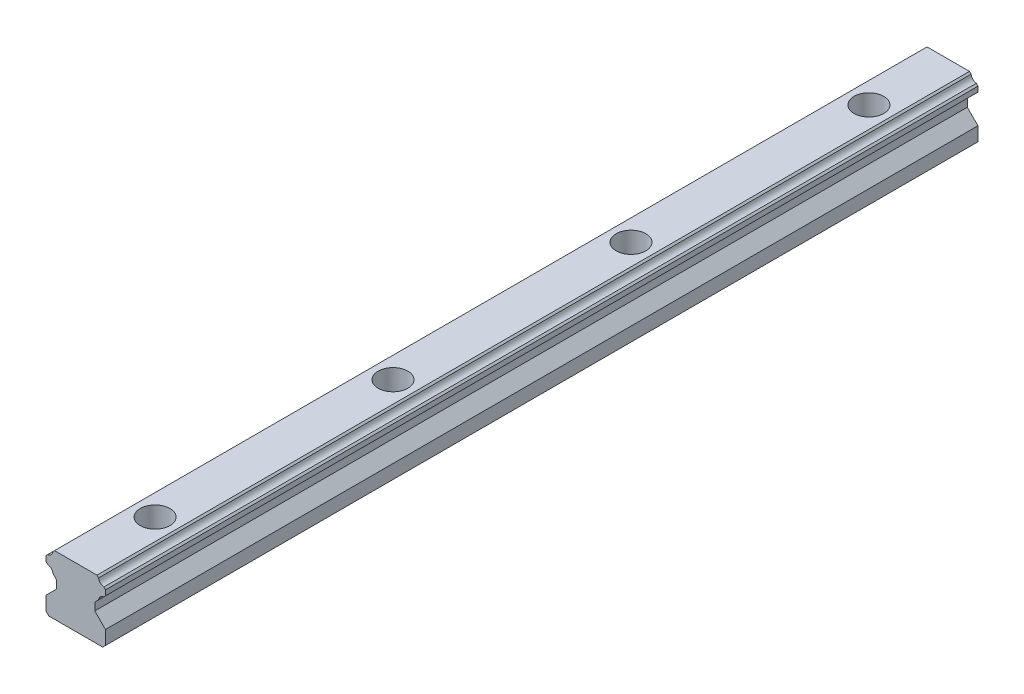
ISO-10303-21;
HEADER;
FILE_DESCRIPTION(('STEP AP214'),'2;1');
FILE_NAME('part.step','',(''),(''),'','','');
FILE_SCHEMA(('AUTOMOTIVE_DESIGN { 1 0 10303 214 1 1 1 1 }'));
ENDSEC;
DATA;
#1=APPLICATION_CONTEXT('core data for automotive mechanical design processes');
#2=APPLICATION_PROTOCOL_DEFINITION('international standard','automotive_design',2000,#1);
#3=PRODUCT_CONTEXT('',#1,'mechanical');
#4=PRODUCT('Part','Part','',(#3));
#5=PRODUCT_RELATED_PRODUCT_CATEGORY('part','',(#4));
#6=PRODUCT_DEFINITION_FORMATION('','',#4);
#7=PRODUCT_DEFINITION_CONTEXT('part definition',#1,'design');
#8=PRODUCT_DEFINITION('design','',#6,#7);
#9=PRODUCT_DEFINITION_SHAPE('','',#8);
#10=(LENGTH_UNIT() NAMED_UNIT(*) SI_UNIT(.MILLI.,.METRE.));
#11=(NAMED_UNIT(*) PLANE_ANGLE_UNIT() SI_UNIT($,.RADIAN.));
#12=(NAMED_UNIT(*) SI_UNIT($,.STERADIAN.) SOLID_ANGLE_UNIT());
#13=UNCERTAINTY_MEASURE_WITH_UNIT(LENGTH_MEASURE(1.E-05),#10,'distance_accuracy_value','');
#14=(GEOMETRIC_REPRESENTATION_CONTEXT(3) GLOBAL_UNCERTAINTY_ASSIGNED_CONTEXT((#13)) GLOBAL_UNIT_ASSIGNED_CONTEXT((#10,
#11,#12)) REPRESENTATION_CONTEXT('',''));
#15=CARTESIAN_POINT('',(0.,0.,0.));
#16=DIRECTION('',(0.,0.,1.));
#17=DIRECTION('',(1.,0.,0.));
#18=AXIS2_PLACEMENT_3D('',#15,#16,#17);
#19=CARTESIAN_POINT('',(0.,15.0000000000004,-90.));
#20=DIRECTION('',(0.,1.,0.));
#21=DIRECTION('',(0.,0.,1.));
#22=AXIS2_PLACEMENT_3D('',#19,#20,#21);
#23=CYLINDRICAL_SURFACE('',#22,3.75);
#24=CARTESIAN_POINT('',(0.,9.70000000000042,-90.));
#25=DIRECTION('',(0.,1.,0.));
#26=DIRECTION('',(0.,0.,1.));
#27=AXIS2_PLACEMENT_3D('',#24,#25,#26);
#28=CIRCLE('',#27,3.75);
#29=CARTESIAN_POINT('',(0.,9.70000000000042,-86.25));
#30=VERTEX_POINT('',#29);
#31=EDGE_CURVE('E11',#30,#30,#28,.T.);
#32=ORIENTED_EDGE('',*,*,#31,.F.);
#33=EDGE_LOOP('',(#32));
#34=FACE_BOUND('',#33,.T.);
#35=CARTESIAN_POINT('',(0.,15.0000000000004,-90.));
#36=DIRECTION('',(0.,1.,0.));
#37=DIRECTION('',(0.,0.,1.));
#38=AXIS2_PLACEMENT_3D('',#35,#36,#37);
#39=CIRCLE('',#38,3.75);
#40=CARTESIAN_POINT('',(0.,15.0000000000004,-86.25));
#41=VERTEX_POINT('',#40);
#42=EDGE_CURVE('E355',#41,#41,#39,.T.);
#43=ORIENTED_EDGE('',*,*,#42,.T.);
#44=EDGE_LOOP('',(#43));
#45=FACE_BOUND('',#44,.T.);
#46=ADVANCED_FACE('F35',(#34,#45),#23,.F.);
#47=CARTESIAN_POINT('',(2.25,9.70000000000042,-90.));
#48=DIRECTION('',(0.,-1.,0.));
#49=DIRECTION('',(0.,0.,-1.));
#50=AXIS2_PLACEMENT_3D('',#47,#48,#49);
#51=PLANE('',#50);
#52=CARTESIAN_POINT('',(0.,9.70000000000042,-90.));
#53=DIRECTION('',(0.,1.,0.));
#54=DIRECTION('',(0.,0.,1.));
#55=AXIS2_PLACEMENT_3D('',#52,#53,#54);
#56=CIRCLE('',#55,2.25);
#57=CARTESIAN_POINT('',(0.,9.70000000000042,-87.75));
#58=VERTEX_POINT('',#57);
#59=EDGE_CURVE('E43',#58,#58,#56,.T.);
#60=ORIENTED_EDGE('',*,*,#59,.F.);
#61=EDGE_LOOP('',(#60));
#62=FACE_BOUND('',#61,.T.);
#63=ORIENTED_EDGE('',*,*,#31,.T.);
#64=EDGE_LOOP('',(#63));
#65=FACE_BOUND('',#64,.T.);
#66=ADVANCED_FACE('F365',(#62,#65),#51,.F.);
#67=CARTESIAN_POINT('',(0.,15.0000000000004,-90.));
#68=DIRECTION('',(0.,1.,0.));
#69=DIRECTION('',(0.,0.,1.));
#70=AXIS2_PLACEMENT_3D('',#67,#68,#69);
#71=CYLINDRICAL_SURFACE('',#70,2.25);
#72=CARTESIAN_POINT('',(0.,0.,-90.));
#73=DIRECTION('',(0.,1.,0.));
#74=DIRECTION('',(0.,0.,1.));
#75=AXIS2_PLACEMENT_3D('',#72,#73,#74);
#76=CIRCLE('',#75,2.25);
#77=CARTESIAN_POINT('',(0.,0.,-87.75));
#78=VERTEX_POINT('',#77);
#79=EDGE_CURVE('E358',#78,#78,#76,.T.);
#80=ORIENTED_EDGE('',*,*,#79,.F.);
#81=EDGE_LOOP('',(#80));
#82=FACE_BOUND('',#81,.T.);
#83=ORIENTED_EDGE('',*,*,#59,.T.);
#84=EDGE_LOOP('',(#83));
#85=FACE_BOUND('',#84,.T.);
#86=ADVANCED_FACE('F363',(#82,#85),#71,.F.);
#87=CARTESIAN_POINT('',(0.,15.0000000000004,-30.));
#88=DIRECTION('',(0.,1.,0.));
#89=DIRECTION('',(0.,0.,1.));
#90=AXIS2_PLACEMENT_3D('',#87,#88,#89);
#91=CYLINDRICAL_SURFACE('',#90,3.75);
#92=CARTESIAN_POINT('',(0.,9.70000000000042,-30.));
#93=DIRECTION('',(0.,1.,0.));
#94=DIRECTION('',(0.,0.,1.));
#95=AXIS2_PLACEMENT_3D('',#92,#93,#94);
#96=CIRCLE('',#95,3.75);
#97=CARTESIAN_POINT('',(0.,9.70000000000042,-26.25));
#98=VERTEX_POINT('',#97);
#99=EDGE_CURVE('E352',#98,#98,#96,.T.);
#100=ORIENTED_EDGE('',*,*,#99,.F.);
#101=EDGE_LOOP('',(#100));
#102=FACE_BOUND('',#101,.T.);
#103=CARTESIAN_POINT('',(0.,15.0000000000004,-30.));
#104=DIRECTION('',(0.,1.,0.));
#105=DIRECTION('',(0.,0.,1.));
#106=AXIS2_PLACEMENT_3D('',#103,#104,#105);
#107=CIRCLE('',#106,3.75);
#108=CARTESIAN_POINT('',(0.,15.0000000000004,-26.25));
#109=VERTEX_POINT('',#108);
#110=EDGE_CURVE('E298',#109,#109,#107,.T.);
#111=ORIENTED_EDGE('',*,*,#110,.T.);
#112=EDGE_LOOP('',(#111));
#113=FACE_BOUND('',#112,.T.);
#114=ADVANCED_FACE('F479',(#102,#113),#91,.F.);
#115=CARTESIAN_POINT('',(2.25,9.70000000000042,-30.));
#116=DIRECTION('',(0.,-1.,0.));
#117=DIRECTION('',(0.,0.,-1.));
#118=AXIS2_PLACEMENT_3D('',#115,#116,#117);
#119=PLANE('',#118);
#120=CARTESIAN_POINT('',(0.,9.70000000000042,-30.));
#121=DIRECTION('',(0.,1.,0.));
#122=DIRECTION('',(0.,0.,1.));
#123=AXIS2_PLACEMENT_3D('',#120,#121,#122);
#124=CIRCLE('',#123,2.25);
#125=CARTESIAN_POINT('',(0.,9.70000000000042,-27.75));
#126=VERTEX_POINT('',#125);
#127=EDGE_CURVE('E349',#126,#126,#124,.T.);
#128=ORIENTED_EDGE('',*,*,#127,.F.);
#129=EDGE_LOOP('',(#128));
#130=FACE_BOUND('',#129,.T.);
#131=ORIENTED_EDGE('',*,*,#99,.T.);
#132=EDGE_LOOP('',(#131));
#133=FACE_BOUND('',#132,.T.);
#134=ADVANCED_FACE('F475',(#130,#133),#119,.F.);
#135=CARTESIAN_POINT('',(0.,15.0000000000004,-30.));
#136=DIRECTION('',(0.,1.,0.));
#137=DIRECTION('',(0.,0.,1.));
#138=AXIS2_PLACEMENT_3D('',#135,#136,#137);
#139=CYLINDRICAL_SURFACE('',#138,2.25);
#140=CARTESIAN_POINT('',(0.,0.,-30.));
#141=DIRECTION('',(0.,1.,0.));
#142=DIRECTION('',(0.,0.,1.));
#143=AXIS2_PLACEMENT_3D('',#140,#141,#142);
#144=CIRCLE('',#143,2.25);
#145=CARTESIAN_POINT('',(0.,0.,-27.75));
#146=VERTEX_POINT('',#145);
#147=EDGE_CURVE('E346',#146,#146,#144,.T.);
#148=ORIENTED_EDGE('',*,*,#147,.F.);
#149=EDGE_LOOP('',(#148));
#150=FACE_BOUND('',#149,.T.);
#151=ORIENTED_EDGE('',*,*,#127,.T.);
#152=EDGE_LOOP('',(#151));
#153=FACE_BOUND('',#152,.T.);
#154=ADVANCED_FACE('F384',(#150,#153),#139,.F.);
#155=CARTESIAN_POINT('',(5.35001970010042,15.0000000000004,110.));
#156=DIRECTION('',(0.707114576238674,0.707098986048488,0.));
#157=DIRECTION('',(-0.707098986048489,0.707114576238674,0.));
#158=AXIS2_PLACEMENT_3D('',#155,#156,#157);
#159=PLANE('',#158);
#160=DIRECTION('',(0.707098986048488,-0.707114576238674,0.));
#161=VECTOR('',#160,1.);
#162=CARTESIAN_POINT('',(5.35001970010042,15.0000000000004,-110.));
#163=LINE('',#162,#161);
#164=CARTESIAN_POINT('',(5.35001970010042,15.0000000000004,-110.));
#165=VERTEX_POINT('',#164);
#166=CARTESIAN_POINT('',(5.75594681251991,14.5940639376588,-110.));
#167=VERTEX_POINT('',#166);
#168=EDGE_CURVE('E231',#165,#167,#163,.T.);
#169=ORIENTED_EDGE('',*,*,#168,.F.);
#170=DIRECTION('',(0.,0.,-1.));
#171=VECTOR('',#170,1.);
#172=CARTESIAN_POINT('',(5.35001970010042,15.0000000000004,110.));
#173=LINE('',#172,#171);
#174=CARTESIAN_POINT('',(5.35001970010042,15.0000000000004,110.));
#175=VERTEX_POINT('',#174);
#176=EDGE_CURVE('E51',#175,#165,#173,.T.);
#177=ORIENTED_EDGE('',*,*,#176,.F.);
#178=DIRECTION('',(0.707098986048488,-0.707114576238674,0.));
#179=VECTOR('',#178,1.);
#180=CARTESIAN_POINT('',(5.35001970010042,15.0000000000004,110.));
#181=LINE('',#180,#179);
#182=CARTESIAN_POINT('',(5.75594681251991,14.5940639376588,110.));
#183=VERTEX_POINT('',#182);
#184=EDGE_CURVE('E296',#175,#183,#181,.T.);
#185=ORIENTED_EDGE('',*,*,#184,.T.);
#186=DIRECTION('',(0.,0.,-1.));
#187=VECTOR('',#186,1.);
#188=CARTESIAN_POINT('',(5.75594681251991,14.5940639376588,110.));
#189=LINE('',#188,#187);
#190=EDGE_CURVE('E140',#183,#167,#189,.T.);
#191=ORIENTED_EDGE('',*,*,#190,.T.);
#192=EDGE_LOOP('',(#169,#177,#185,#191));
#193=FACE_BOUND('',#192,.T.);
#194=ADVANCED_FACE('F376',(#193),#159,.T.);
#195=CARTESIAN_POINT('',(5.35001970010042,15.0000000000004,110.));
#196=DIRECTION('',(0.,-1.,0.));
#197=DIRECTION('',(0.,0.,-1.));
#198=AXIS2_PLACEMENT_3D('',#195,#196,#197);
#199=PLANE('',#198);
#200=CARTESIAN_POINT('',(0.,15.0000000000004,30.));
#201=DIRECTION('',(0.,1.,0.));
#202=DIRECTION('',(0.,0.,1.));
#203=AXIS2_PLACEMENT_3D('',#200,#201,#202);
#204=CIRCLE('',#203,3.75);
#205=CARTESIAN_POINT('',(0.,15.0000000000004,33.75));
#206=VERTEX_POINT('',#205);
#207=EDGE_CURVE('E739',#206,#206,#204,.T.);
#208=ORIENTED_EDGE('',*,*,#207,.F.);
#209=EDGE_LOOP('',(#208));
#210=FACE_BOUND('',#209,.T.);
#211=CARTESIAN_POINT('',(0.,15.0000000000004,90.));
#212=DIRECTION('',(0.,1.,0.));
#213=DIRECTION('',(0.,0.,1.));
#214=AXIS2_PLACEMENT_3D('',#211,#212,#213);
#215=CIRCLE('',#214,3.75);
#216=CARTESIAN_POINT('',(0.,15.0000000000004,93.75));
#217=VERTEX_POINT('',#216);
#218=EDGE_CURVE('E749',#217,#217,#215,.T.);
#219=ORIENTED_EDGE('',*,*,#218,.F.);
#220=EDGE_LOOP('',(#219));
#221=FACE_BOUND('',#220,.T.);
#222=DIRECTION('',(-1.,0.,0.));
#223=VECTOR('',#222,1.);
#224=CARTESIAN_POINT('',(5.35001970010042,15.0000000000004,-110.));
#225=LINE('',#224,#223);
#226=CARTESIAN_POINT('',(-5.35001970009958,15.0000000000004,-110.));
#227=VERTEX_POINT('',#226);
#228=EDGE_CURVE('E294',#165,#227,#225,.T.);
#229=ORIENTED_EDGE('',*,*,#228,.T.);
#230=DIRECTION('',(0.,0.,-1.));
#231=VECTOR('',#230,1.);
#232=CARTESIAN_POINT('',(-5.35001970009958,15.0000000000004,110.));
#233=LINE('',#232,#231);
#234=CARTESIAN_POINT('',(-5.35001970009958,15.0000000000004,110.));
#235=VERTEX_POINT('',#234);
#236=EDGE_CURVE('E129',#235,#227,#233,.T.);
#237=ORIENTED_EDGE('',*,*,#236,.F.);
#238=DIRECTION('',(-1.,0.,0.));
#239=VECTOR('',#238,1.);
#240=CARTESIAN_POINT('',(5.35001970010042,15.0000000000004,110.));
#241=LINE('',#240,#239);
#242=EDGE_CURVE('E221',#175,#235,#241,.T.);
#243=ORIENTED_EDGE('',*,*,#242,.F.);
#244=ORIENTED_EDGE('',*,*,#176,.T.);
#245=EDGE_LOOP('',(#229,#237,#243,#244));
#246=FACE_BOUND('',#245,.T.);
#247=ORIENTED_EDGE('',*,*,#110,.F.);
#248=EDGE_LOOP('',(#247));
#249=FACE_BOUND('',#248,.T.);
#250=ORIENTED_EDGE('',*,*,#42,.F.);
#251=EDGE_LOOP('',(#250));
#252=FACE_BOUND('',#251,.T.);
#253=ADVANCED_FACE('F374',(#210,#221,#246,#249,#252),#199,.F.);
#254=CARTESIAN_POINT('',(-5.75594681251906,14.5940639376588,110.));
#255=DIRECTION('',(-0.707114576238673,0.707098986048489,0.));
#256=DIRECTION('',(-0.707098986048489,-0.707114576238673,0.));
#257=AXIS2_PLACEMENT_3D('',#254,#255,#256);
#258=PLANE('',#257);
#259=DIRECTION('',(0.707098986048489,0.707114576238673,0.));
#260=VECTOR('',#259,1.);
#261=CARTESIAN_POINT('',(-5.75594681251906,14.5940639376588,-110.));
#262=LINE('',#261,#260);
#263=CARTESIAN_POINT('',(-5.75594681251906,14.5940639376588,-110.));
#264=VERTEX_POINT('',#263);
#265=EDGE_CURVE('E207',#264,#227,#262,.T.);
#266=ORIENTED_EDGE('',*,*,#265,.F.);
#267=DIRECTION('',(0.,0.,-1.));
#268=VECTOR('',#267,1.);
#269=CARTESIAN_POINT('',(-5.75594681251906,14.5940639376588,110.));
#270=LINE('',#269,#268);
#271=CARTESIAN_POINT('',(-5.75594681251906,14.5940639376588,110.));
#272=VERTEX_POINT('',#271);
#273=EDGE_CURVE('E202',#272,#264,#270,.T.);
#274=ORIENTED_EDGE('',*,*,#273,.F.);
#275=DIRECTION('',(0.707098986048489,0.707114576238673,0.));
#276=VECTOR('',#275,1.);
#277=CARTESIAN_POINT('',(-5.75594681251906,14.5940639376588,110.));
#278=LINE('',#277,#276);
#279=EDGE_CURVE('E205',#272,#235,#278,.T.);
#280=ORIENTED_EDGE('',*,*,#279,.T.);
#281=ORIENTED_EDGE('',*,*,#236,.T.);
#282=EDGE_LOOP('',(#266,#274,#280,#281));
#283=FACE_BOUND('',#282,.T.);
#284=ADVANCED_FACE('F204',(#283),#258,.T.);
#285=CARTESIAN_POINT('',(-7.30050659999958,14.8130040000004,110.));
#286=DIRECTION('',(0.,0.,-1.));
#287=DIRECTION('',(-1.,0.,0.));
#288=AXIS2_PLACEMENT_3D('',#285,#286,#287);
#289=CYLINDRICAL_SURFACE('',#288,1.5599999);
#290=CARTESIAN_POINT('',(-7.30050659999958,14.8130040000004,-110.));
#291=DIRECTION('',(0.,0.,1.));
#292=DIRECTION('',(1.,0.,0.));
#293=AXIS2_PLACEMENT_3D('',#290,#291,#292);
#294=CIRCLE('',#293,1.5599999);
#295=CARTESIAN_POINT('',(-7.08157684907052,13.2684427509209,-110.));
#296=VERTEX_POINT('',#295);
#297=EDGE_CURVE('E291',#296,#264,#294,.T.);
#298=ORIENTED_EDGE('',*,*,#297,.F.);
#299=DIRECTION('',(0.,0.,-1.));
#300=VECTOR('',#299,1.);
#301=CARTESIAN_POINT('',(-7.08157684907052,13.2684427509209,110.));
#302=LINE('',#301,#300);
#303=CARTESIAN_POINT('',(-7.08157684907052,13.2684427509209,110.));
#304=VERTEX_POINT('',#303);
#305=EDGE_CURVE('E212',#304,#296,#302,.T.);
#306=ORIENTED_EDGE('',*,*,#305,.F.);
#307=CARTESIAN_POINT('',(-7.30050659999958,14.8130040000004,110.));
#308=DIRECTION('',(0.,0.,1.));
#309=DIRECTION('',(1.,0.,0.));
#310=AXIS2_PLACEMENT_3D('',#307,#308,#309);
#311=CIRCLE('',#310,1.5599999);
#312=EDGE_CURVE('E219',#304,#272,#311,.T.);
#313=ORIENTED_EDGE('',*,*,#312,.T.);
#314=ORIENTED_EDGE('',*,*,#273,.T.);
#315=EDGE_LOOP('',(#298,#306,#313,#314));
#316=FACE_BOUND('',#315,.T.);
#317=ADVANCED_FACE('F223',(#316),#289,.F.);
#318=CARTESIAN_POINT('',(-7.49999999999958,12.8500204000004,110.));
#319=DIRECTION('',(-0.70710610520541,0.707107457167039,0.));
#320=DIRECTION('',(-0.707107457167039,-0.70710610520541,0.));
#321=AXIS2_PLACEMENT_3D('',#318,#319,#320);
#322=PLANE('',#321);
#323=DIRECTION('',(0.707107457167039,0.707106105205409,0.));
#324=VECTOR('',#323,1.);
#325=CARTESIAN_POINT('',(-7.49999999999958,12.8500204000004,-110.));
#326=LINE('',#325,#324);
#327=CARTESIAN_POINT('',(-7.49999999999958,12.8500204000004,-110.));
#328=VERTEX_POINT('',#327);
#329=EDGE_CURVE('E288',#328,#296,#326,.T.);
#330=ORIENTED_EDGE('',*,*,#329,.F.);
#331=DIRECTION('',(0.,0.,-1.));
#332=VECTOR('',#331,1.);
#333=CARTESIAN_POINT('',(-7.49999999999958,12.8500204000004,110.));
#334=LINE('',#333,#332);
#335=CARTESIAN_POINT('',(-7.49999999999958,12.8500204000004,110.));
#336=VERTEX_POINT('',#335);
#337=EDGE_CURVE('E301',#336,#328,#334,.T.);
#338=ORIENTED_EDGE('',*,*,#337,.F.);
#339=DIRECTION('',(0.707107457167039,0.707106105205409,0.));
#340=VECTOR('',#339,1.);
#341=CARTESIAN_POINT('',(-7.49999999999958,12.8500204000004,110.));
#342=LINE('',#341,#340);
#343=EDGE_CURVE('E224',#336,#304,#342,.T.);
#344=ORIENTED_EDGE('',*,*,#343,.T.);
#345=ORIENTED_EDGE('',*,*,#305,.T.);
#346=EDGE_LOOP('',(#330,#338,#344,#345));
#347=FACE_BOUND('',#346,.T.);
#348=ADVANCED_FACE('F394',(#347),#322,.T.);
#349=CARTESIAN_POINT('',(-7.49999999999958,11.5399866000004,110.));
#350=DIRECTION('',(-1.,0.,0.));
#351=DIRECTION('',(0.,0.,1.));
#352=AXIS2_PLACEMENT_3D('',#349,#350,#351);
#353=PLANE('',#352);
#354=DIRECTION('',(0.,1.,0.));
#355=VECTOR('',#354,1.);
#356=CARTESIAN_POINT('',(-7.49999999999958,11.5399866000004,-110.));
#357=LINE('',#356,#355);
#358=CARTESIAN_POINT('',(-7.49999999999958,11.5399866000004,-110.));
#359=VERTEX_POINT('',#358);
#360=EDGE_CURVE('E285',#359,#328,#357,.T.);
#361=ORIENTED_EDGE('',*,*,#360,.F.);
#362=DIRECTION('',(0.,0.,-1.));
#363=VECTOR('',#362,1.);
#364=CARTESIAN_POINT('',(-7.49999999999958,11.5399866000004,110.));
#365=LINE('',#364,#363);
#366=CARTESIAN_POINT('',(-7.49999999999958,11.5399866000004,110.));
#367=VERTEX_POINT('',#366);
#368=EDGE_CURVE('E303',#367,#359,#365,.T.);
#369=ORIENTED_EDGE('',*,*,#368,.F.);
#370=DIRECTION('',(0.,1.,0.));
#371=VECTOR('',#370,1.);
#372=CARTESIAN_POINT('',(-7.49999999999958,11.5399866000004,110.));
#373=LINE('',#372,#371);
#374=EDGE_CURVE('E226',#367,#336,#373,.T.);
#375=ORIENTED_EDGE('',*,*,#374,.T.);
#376=ORIENTED_EDGE('',*,*,#337,.T.);
#377=EDGE_LOOP('',(#361,#369,#375,#376));
#378=FACE_BOUND('',#377,.T.);
#379=ADVANCED_FACE('F397',(#378),#353,.T.);
#380=CARTESIAN_POINT('',(-7.09432568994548,11.1343120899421,110.));
#381=DIRECTION('',(-0.707106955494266,-0.707106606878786,0.));
#382=DIRECTION('',(0.707106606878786,-0.707106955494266,0.));
#383=AXIS2_PLACEMENT_3D('',#380,#381,#382);
#384=PLANE('',#383);
#385=DIRECTION('',(-0.707106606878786,0.707106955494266,0.));
#386=VECTOR('',#385,1.);
#387=CARTESIAN_POINT('',(-7.09432568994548,11.1343120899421,-110.));
#388=LINE('',#387,#386);
#389=CARTESIAN_POINT('',(-7.09432568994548,11.1343120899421,-110.));
#390=VERTEX_POINT('',#389);
#391=EDGE_CURVE('E282',#390,#359,#388,.T.);
#392=ORIENTED_EDGE('',*,*,#391,.F.);
#393=DIRECTION('',(0.,0.,-1.));
#394=VECTOR('',#393,1.);
#395=CARTESIAN_POINT('',(-7.09432568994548,11.1343120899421,110.));
#396=LINE('',#395,#394);
#397=CARTESIAN_POINT('',(-7.09432568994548,11.1343120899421,110.));
#398=VERTEX_POINT('',#397);
#399=EDGE_CURVE('E305',#398,#390,#396,.T.);
#400=ORIENTED_EDGE('',*,*,#399,.F.);
#401=DIRECTION('',(-0.707106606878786,0.707106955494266,0.));
#402=VECTOR('',#401,1.);
#403=CARTESIAN_POINT('',(-7.09432568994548,11.1343120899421,110.));
#404=LINE('',#403,#402);
#405=EDGE_CURVE('E805',#398,#367,#404,.T.);
#406=ORIENTED_EDGE('',*,*,#405,.T.);
#407=ORIENTED_EDGE('',*,*,#368,.T.);
#408=EDGE_LOOP('',(#392,#400,#406,#407));
#409=FACE_BOUND('',#408,.T.);
#410=ADVANCED_FACE('F401',(#409),#384,.T.);
#411=CARTESIAN_POINT('',(-7.30050659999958,9.58799740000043,110.));
#412=DIRECTION('',(0.,0.,-1.));
#413=DIRECTION('',(-1.,0.,0.));
#414=AXIS2_PLACEMENT_3D('',#411,#412,#413);
#415=CYLINDRICAL_SURFACE('',#414,1.5599999);
#416=CARTESIAN_POINT('',(-7.30050659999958,9.58799740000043,-110.));
#417=DIRECTION('',(0.,0.,1.));
#418=DIRECTION('',(1.,0.,0.));
#419=AXIS2_PLACEMENT_3D('',#416,#417,#418);
#420=CIRCLE('',#419,1.5599999);
#421=CARTESIAN_POINT('',(-5.75419201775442,9.79417911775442,-110.));
#422=VERTEX_POINT('',#421);
#423=EDGE_CURVE('E279',#422,#390,#420,.T.);
#424=ORIENTED_EDGE('',*,*,#423,.F.);
#425=DIRECTION('',(0.,0.,-1.));
#426=VECTOR('',#425,1.);
#427=CARTESIAN_POINT('',(-5.75419201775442,9.79417911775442,110.));
#428=LINE('',#427,#426);
#429=CARTESIAN_POINT('',(-5.75419201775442,9.79417911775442,110.));
#430=VERTEX_POINT('',#429);
#431=EDGE_CURVE('E307',#430,#422,#428,.T.);
#432=ORIENTED_EDGE('',*,*,#431,.F.);
#433=CARTESIAN_POINT('',(-7.30050659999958,9.58799740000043,110.));
#434=DIRECTION('',(0.,0.,1.));
#435=DIRECTION('',(1.,0.,0.));
#436=AXIS2_PLACEMENT_3D('',#433,#434,#435);
#437=CIRCLE('',#436,1.5599999);
#438=EDGE_CURVE('E802',#430,#398,#437,.T.);
#439=ORIENTED_EDGE('',*,*,#438,.T.);
#440=ORIENTED_EDGE('',*,*,#399,.T.);
#441=EDGE_LOOP('',(#424,#432,#439,#440));
#442=FACE_BOUND('',#441,.T.);
#443=ADVANCED_FACE('F405',(#442),#415,.F.);
#444=CARTESIAN_POINT('',(-4.8000183,8.8400054,110.));
#445=DIRECTION('',(-0.707106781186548,-0.707106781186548,0.));
#446=DIRECTION('',(0.707106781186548,-0.707106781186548,0.));
#447=AXIS2_PLACEMENT_3D('',#444,#445,#446);
#448=PLANE('',#447);
#449=DIRECTION('',(-0.707106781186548,0.707106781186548,0.));
#450=VECTOR('',#449,1.);
#451=CARTESIAN_POINT('',(-4.8000183,8.8400054,-110.));
#452=LINE('',#451,#450);
#453=CARTESIAN_POINT('',(-4.8000183,8.8400054,-110.));
#454=VERTEX_POINT('',#453);
#455=EDGE_CURVE('E276',#454,#422,#452,.T.);
#456=ORIENTED_EDGE('',*,*,#455,.F.);
#457=DIRECTION('',(0.,0.,-1.));
#458=VECTOR('',#457,1.);
#459=CARTESIAN_POINT('',(-4.8000183,8.8400054,110.));
#460=LINE('',#459,#458);
#461=CARTESIAN_POINT('',(-4.8000183,8.8400054,110.));
#462=VERTEX_POINT('',#461);
#463=EDGE_CURVE('E309',#462,#454,#460,.T.);
#464=ORIENTED_EDGE('',*,*,#463,.F.);
#465=DIRECTION('',(-0.707106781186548,0.707106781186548,0.));
#466=VECTOR('',#465,1.);
#467=CARTESIAN_POINT('',(-4.8000183,8.8400054,110.));
#468=LINE('',#467,#466);
#469=EDGE_CURVE('E799',#462,#430,#468,.T.);
#470=ORIENTED_EDGE('',*,*,#469,.T.);
#471=ORIENTED_EDGE('',*,*,#431,.T.);
#472=EDGE_LOOP('',(#456,#464,#470,#471));
#473=FACE_BOUND('',#472,.T.);
#474=ADVANCED_FACE('F409',(#473),#448,.T.);
#475=CARTESIAN_POINT('',(-4.8000183,8.8400054,110.));
#476=DIRECTION('',(1.,0.,0.));
#477=DIRECTION('',(0.,0.,-1.));
#478=AXIS2_PLACEMENT_3D('',#475,#476,#477);
#479=PLANE('',#478);
#480=DIRECTION('',(0.,-1.,0.));
#481=VECTOR('',#480,1.);
#482=CARTESIAN_POINT('',(-4.8000183,8.8400054,-110.));
#483=LINE('',#482,#481);
#484=CARTESIAN_POINT('',(-4.8000183,6.9000063,-110.));
#485=VERTEX_POINT('',#484);
#486=EDGE_CURVE('E274',#454,#485,#483,.T.);
#487=ORIENTED_EDGE('',*,*,#486,.T.);
#488=DIRECTION('',(0.,0.,-1.));
#489=VECTOR('',#488,1.);
#490=CARTESIAN_POINT('',(-4.8000183,6.9000063,110.));
#491=LINE('',#490,#489);
#492=CARTESIAN_POINT('',(-4.8000183,6.9000063,110.));
#493=VERTEX_POINT('',#492);
#494=EDGE_CURVE('E311',#493,#485,#491,.T.);
#495=ORIENTED_EDGE('',*,*,#494,.F.);
#496=DIRECTION('',(0.,-1.,0.));
#497=VECTOR('',#496,1.);
#498=CARTESIAN_POINT('',(-4.8000183,8.8400054,110.));
#499=LINE('',#498,#497);
#500=EDGE_CURVE('E797',#462,#493,#499,.T.);
#501=ORIENTED_EDGE('',*,*,#500,.F.);
#502=ORIENTED_EDGE('',*,*,#463,.T.);
#503=EDGE_LOOP('',(#487,#495,#501,#502));
#504=FACE_BOUND('',#503,.T.);
#505=ADVANCED_FACE('F413',(#504),#479,.F.);
#506=CARTESIAN_POINT('',(-4.8000183,6.9000063,110.));
#507=DIRECTION('',(0.707106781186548,-0.707106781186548,0.));
#508=DIRECTION('',(0.707106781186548,0.707106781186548,0.));
#509=AXIS2_PLACEMENT_3D('',#506,#507,#508);
#510=PLANE('',#509);
#511=DIRECTION('',(-0.707106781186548,-0.707106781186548,0.));
#512=VECTOR('',#511,1.);
#513=CARTESIAN_POINT('',(-4.8000183,6.9000063,-110.));
#514=LINE('',#513,#512);
#515=CARTESIAN_POINT('',(-7.5,4.2000246,-110.));
#516=VERTEX_POINT('',#515);
#517=EDGE_CURVE('E272',#485,#516,#514,.T.);
#518=ORIENTED_EDGE('',*,*,#517,.T.);
#519=DIRECTION('',(0.,0.,-1.));
#520=VECTOR('',#519,1.);
#521=CARTESIAN_POINT('',(-7.5,4.2000246,110.));
#522=LINE('',#521,#520);
#523=CARTESIAN_POINT('',(-7.5,4.2000246,110.));
#524=VERTEX_POINT('',#523);
#525=EDGE_CURVE('E314',#524,#516,#522,.T.);
#526=ORIENTED_EDGE('',*,*,#525,.F.);
#527=DIRECTION('',(-0.707106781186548,-0.707106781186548,0.));
#528=VECTOR('',#527,1.);
#529=CARTESIAN_POINT('',(-4.8000183,6.9000063,110.));
#530=LINE('',#529,#528);
#531=EDGE_CURVE('E795',#493,#524,#530,.T.);
#532=ORIENTED_EDGE('',*,*,#531,.F.);
#533=ORIENTED_EDGE('',*,*,#494,.T.);
#534=EDGE_LOOP('',(#518,#526,#532,#533));
#535=FACE_BOUND('',#534,.T.);
#536=ADVANCED_FACE('F417',(#535),#510,.F.);
#537=CARTESIAN_POINT('',(-7.5,4.2000246,110.));
#538=DIRECTION('',(1.,0.,0.));
#539=DIRECTION('',(0.,0.,-1.));
#540=AXIS2_PLACEMENT_3D('',#537,#538,#539);
#541=PLANE('',#540);
#542=DIRECTION('',(0.,-1.,0.));
#543=VECTOR('',#542,1.);
#544=CARTESIAN_POINT('',(-7.5,4.2000246,-110.));
#545=LINE('',#544,#543);
#546=CARTESIAN_POINT('',(-7.5,0.69999271,-110.));
#547=VERTEX_POINT('',#546);
#548=EDGE_CURVE('E269',#516,#547,#545,.T.);
#549=ORIENTED_EDGE('',*,*,#548,.T.);
#550=DIRECTION('',(0.,0.,-1.));
#551=VECTOR('',#550,1.);
#552=CARTESIAN_POINT('',(-7.5,0.69999271,110.));
#553=LINE('',#552,#551);
#554=CARTESIAN_POINT('',(-7.5,0.69999271,110.));
#555=VERTEX_POINT('',#554);
#556=EDGE_CURVE('E317',#555,#547,#553,.T.);
#557=ORIENTED_EDGE('',*,*,#556,.F.);
#558=DIRECTION('',(0.,-1.,0.));
#559=VECTOR('',#558,1.);
#560=CARTESIAN_POINT('',(-7.5,4.2000246,110.));
#561=LINE('',#560,#559);
#562=EDGE_CURVE('E793',#524,#555,#561,.T.);
#563=ORIENTED_EDGE('',*,*,#562,.F.);
#564=ORIENTED_EDGE('',*,*,#525,.T.);
#565=EDGE_LOOP('',(#549,#557,#563,#564));
#566=FACE_BOUND('',#565,.T.);
#567=ADVANCED_FACE('F421',(#566),#541,.F.);
#568=CARTESIAN_POINT('',(-6.8000072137,0.,110.));
#569=DIRECTION('',(-0.707106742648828,-0.707106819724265,0.));
#570=DIRECTION('',(0.707106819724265,-0.707106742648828,0.));
#571=AXIS2_PLACEMENT_3D('',#568,#569,#570);
#572=PLANE('',#571);
#573=DIRECTION('',(-0.707106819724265,0.707106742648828,0.));
#574=VECTOR('',#573,1.);
#575=CARTESIAN_POINT('',(-6.8000072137,0.,-110.));
#576=LINE('',#575,#574);
#577=CARTESIAN_POINT('',(-6.8000072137,0.,-110.));
#578=VERTEX_POINT('',#577);
#579=EDGE_CURVE('E266',#578,#547,#576,.T.);
#580=ORIENTED_EDGE('',*,*,#579,.F.);
#581=DIRECTION('',(0.,0.,-1.));
#582=VECTOR('',#581,1.);
#583=CARTESIAN_POINT('',(-6.8000072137,0.,110.));
#584=LINE('',#583,#582);
#585=CARTESIAN_POINT('',(-6.8000072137,0.,110.));
#586=VERTEX_POINT('',#585);
#587=EDGE_CURVE('E319',#586,#578,#584,.T.);
#588=ORIENTED_EDGE('',*,*,#587,.F.);
#589=DIRECTION('',(-0.707106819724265,0.707106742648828,0.));
#590=VECTOR('',#589,1.);
#591=CARTESIAN_POINT('',(-6.8000072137,0.,110.));
#592=LINE('',#591,#590);
#593=EDGE_CURVE('E790',#586,#555,#592,.T.);
#594=ORIENTED_EDGE('',*,*,#593,.T.);
#595=ORIENTED_EDGE('',*,*,#556,.T.);
#596=EDGE_LOOP('',(#580,#588,#594,#595));
#597=FACE_BOUND('',#596,.T.);
#598=ADVANCED_FACE('F425',(#597),#572,.T.);
#599=CARTESIAN_POINT('',(6.8000072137,0.,110.));
#600=DIRECTION('',(0.,-1.,0.));
#601=DIRECTION('',(0.,0.,-1.));
#602=AXIS2_PLACEMENT_3D('',#599,#600,#601);
#603=PLANE('',#602);
#604=CARTESIAN_POINT('',(0.,0.,30.));
#605=DIRECTION('',(0.,1.,0.));
#606=DIRECTION('',(0.,0.,1.));
#607=AXIS2_PLACEMENT_3D('',#604,#605,#606);
#608=CIRCLE('',#607,2.25);
#609=CARTESIAN_POINT('',(0.,0.,32.25));
#610=VERTEX_POINT('',#609);
#611=EDGE_CURVE('E740',#610,#610,#608,.T.);
#612=ORIENTED_EDGE('',*,*,#611,.T.);
#613=EDGE_LOOP('',(#612));
#614=FACE_BOUND('',#613,.T.);
#615=CARTESIAN_POINT('',(0.,0.,90.));
#616=DIRECTION('',(0.,1.,0.));
#617=DIRECTION('',(0.,0.,1.));
#618=AXIS2_PLACEMENT_3D('',#615,#616,#617);
#619=CIRCLE('',#618,2.25);
#620=CARTESIAN_POINT('',(0.,0.,92.25));
#621=VERTEX_POINT('',#620);
#622=EDGE_CURVE('E235',#621,#621,#619,.T.);
#623=ORIENTED_EDGE('',*,*,#622,.T.);
#624=EDGE_LOOP('',(#623));
#625=FACE_BOUND('',#624,.T.);
#626=DIRECTION('',(-1.,0.,0.));
#627=VECTOR('',#626,1.);
#628=CARTESIAN_POINT('',(6.8000072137,0.,-110.));
#629=LINE('',#628,#627);
#630=CARTESIAN_POINT('',(6.8000072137,0.,-110.));
#631=VERTEX_POINT('',#630);
#632=EDGE_CURVE('E263',#631,#578,#629,.T.);
#633=ORIENTED_EDGE('',*,*,#632,.F.);
#634=DIRECTION('',(0.,0.,-1.));
#635=VECTOR('',#634,1.);
#636=CARTESIAN_POINT('',(6.8000072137,0.,110.));
#637=LINE('',#636,#635);
#638=CARTESIAN_POINT('',(6.8000072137,0.,110.));
#639=VERTEX_POINT('',#638);
#640=EDGE_CURVE('E321',#639,#631,#637,.T.);
#641=ORIENTED_EDGE('',*,*,#640,.F.);
#642=DIRECTION('',(-1.,0.,0.));
#643=VECTOR('',#642,1.);
#644=CARTESIAN_POINT('',(6.8000072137,0.,110.));
#645=LINE('',#644,#643);
#646=EDGE_CURVE('E787',#639,#586,#645,.T.);
#647=ORIENTED_EDGE('',*,*,#646,.T.);
#648=ORIENTED_EDGE('',*,*,#587,.T.);
#649=EDGE_LOOP('',(#633,#641,#647,#648));
#650=FACE_BOUND('',#649,.T.);
#651=ORIENTED_EDGE('',*,*,#147,.T.);
#652=EDGE_LOOP('',(#651));
#653=FACE_BOUND('',#652,.T.);
#654=ORIENTED_EDGE('',*,*,#79,.T.);
#655=EDGE_LOOP('',(#654));
#656=FACE_BOUND('',#655,.T.);
#657=ADVANCED_FACE('F429',(#614,#625,#650,#653,#656),#603,.T.);
#658=CARTESIAN_POINT('',(7.5,0.69999271,110.));
#659=DIRECTION('',(0.707106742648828,-0.707106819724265,0.));
#660=DIRECTION('',(0.707106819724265,0.707106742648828,0.));
#661=AXIS2_PLACEMENT_3D('',#658,#659,#660);
#662=PLANE('',#661);
#663=DIRECTION('',(-0.707106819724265,-0.707106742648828,0.));
#664=VECTOR('',#663,1.);
#665=CARTESIAN_POINT('',(7.5,0.69999271,-110.));
#666=LINE('',#665,#664);
#667=CARTESIAN_POINT('',(7.5,0.69999271,-110.));
#668=VERTEX_POINT('',#667);
#669=EDGE_CURVE('E260',#668,#631,#666,.T.);
#670=ORIENTED_EDGE('',*,*,#669,.F.);
#671=DIRECTION('',(0.,0.,-1.));
#672=VECTOR('',#671,1.);
#673=CARTESIAN_POINT('',(7.5,0.69999271,110.));
#674=LINE('',#673,#672);
#675=CARTESIAN_POINT('',(7.5,0.69999271,110.));
#676=VERTEX_POINT('',#675);
#677=EDGE_CURVE('E323',#676,#668,#674,.T.);
#678=ORIENTED_EDGE('',*,*,#677,.F.);
#679=DIRECTION('',(-0.707106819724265,-0.707106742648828,0.));
#680=VECTOR('',#679,1.);
#681=CARTESIAN_POINT('',(7.5,0.69999271,110.));
#682=LINE('',#681,#680);
#683=EDGE_CURVE('E784',#676,#639,#682,.T.);
#684=ORIENTED_EDGE('',*,*,#683,.T.);
#685=ORIENTED_EDGE('',*,*,#640,.T.);
#686=EDGE_LOOP('',(#670,#678,#684,#685));
#687=FACE_BOUND('',#686,.T.);
#688=ADVANCED_FACE('F433',(#687),#662,.T.);
#689=CARTESIAN_POINT('',(7.5,0.69999271,110.));
#690=DIRECTION('',(-1.,0.,0.));
#691=DIRECTION('',(0.,0.,1.));
#692=AXIS2_PLACEMENT_3D('',#689,#690,#691);
#693=PLANE('',#692);
#694=DIRECTION('',(0.,1.,0.));
#695=VECTOR('',#694,1.);
#696=CARTESIAN_POINT('',(7.5,0.69999271,-110.));
#697=LINE('',#696,#695);
#698=CARTESIAN_POINT('',(7.5,4.2000246,-110.));
#699=VERTEX_POINT('',#698);
#700=EDGE_CURVE('E258',#668,#699,#697,.T.);
#701=ORIENTED_EDGE('',*,*,#700,.T.);
#702=DIRECTION('',(0.,0.,-1.));
#703=VECTOR('',#702,1.);
#704=CARTESIAN_POINT('',(7.5,4.2000246,110.));
#705=LINE('',#704,#703);
#706=CARTESIAN_POINT('',(7.5,4.2000246,110.));
#707=VERTEX_POINT('',#706);
#708=EDGE_CURVE('E325',#707,#699,#705,.T.);
#709=ORIENTED_EDGE('',*,*,#708,.F.);
#710=DIRECTION('',(0.,1.,0.));
#711=VECTOR('',#710,1.);
#712=CARTESIAN_POINT('',(7.5,0.69999271,110.));
#713=LINE('',#712,#711);
#714=EDGE_CURVE('E782',#676,#707,#713,.T.);
#715=ORIENTED_EDGE('',*,*,#714,.F.);
#716=ORIENTED_EDGE('',*,*,#677,.T.);
#717=EDGE_LOOP('',(#701,#709,#715,#716));
#718=FACE_BOUND('',#717,.T.);
#719=ADVANCED_FACE('F437',(#718),#693,.F.);
#720=CARTESIAN_POINT('',(7.5,4.2000246,110.));
#721=DIRECTION('',(-0.707106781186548,-0.707106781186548,0.));
#722=DIRECTION('',(0.707106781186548,-0.707106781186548,0.));
#723=AXIS2_PLACEMENT_3D('',#720,#721,#722);
#724=PLANE('',#723);
#725=DIRECTION('',(-0.707106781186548,0.707106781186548,0.));
#726=VECTOR('',#725,1.);
#727=CARTESIAN_POINT('',(7.5,4.2000246,-110.));
#728=LINE('',#727,#726);
#729=CARTESIAN_POINT('',(4.8000183,6.9000063,-110.));
#730=VERTEX_POINT('',#729);
#731=EDGE_CURVE('E256',#699,#730,#728,.T.);
#732=ORIENTED_EDGE('',*,*,#731,.T.);
#733=DIRECTION('',(0.,0.,-1.));
#734=VECTOR('',#733,1.);
#735=CARTESIAN_POINT('',(4.8000183,6.9000063,110.));
#736=LINE('',#735,#734);
#737=CARTESIAN_POINT('',(4.8000183,6.9000063,110.));
#738=VERTEX_POINT('',#737);
#739=EDGE_CURVE('E328',#738,#730,#736,.T.);
#740=ORIENTED_EDGE('',*,*,#739,.F.);
#741=DIRECTION('',(-0.707106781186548,0.707106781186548,0.));
#742=VECTOR('',#741,1.);
#743=CARTESIAN_POINT('',(7.5,4.2000246,110.));
#744=LINE('',#743,#742);
#745=EDGE_CURVE('E780',#707,#738,#744,.T.);
#746=ORIENTED_EDGE('',*,*,#745,.F.);
#747=ORIENTED_EDGE('',*,*,#708,.T.);
#748=EDGE_LOOP('',(#732,#740,#746,#747));
#749=FACE_BOUND('',#748,.T.);
#750=ADVANCED_FACE('F441',(#749),#724,.F.);
#751=CARTESIAN_POINT('',(4.8000183,6.9000063,110.));
#752=DIRECTION('',(-1.,0.,0.));
#753=DIRECTION('',(0.,0.,1.));
#754=AXIS2_PLACEMENT_3D('',#751,#752,#753);
#755=PLANE('',#754);
#756=DIRECTION('',(0.,1.,0.));
#757=VECTOR('',#756,1.);
#758=CARTESIAN_POINT('',(4.8000183,6.9000063,-110.));
#759=LINE('',#758,#757);
#760=CARTESIAN_POINT('',(4.8000183,8.8400054,-110.));
#761=VERTEX_POINT('',#760);
#762=EDGE_CURVE('E253',#730,#761,#759,.T.);
#763=ORIENTED_EDGE('',*,*,#762,.T.);
#764=DIRECTION('',(0.,0.,-1.));
#765=VECTOR('',#764,1.);
#766=CARTESIAN_POINT('',(4.8000183,8.8400054,110.));
#767=LINE('',#766,#765);
#768=CARTESIAN_POINT('',(4.8000183,8.8400054,110.));
#769=VERTEX_POINT('',#768);
#770=EDGE_CURVE('E331',#769,#761,#767,.T.);
#771=ORIENTED_EDGE('',*,*,#770,.F.);
#772=DIRECTION('',(0.,1.,0.));
#773=VECTOR('',#772,1.);
#774=CARTESIAN_POINT('',(4.8000183,6.9000063,110.));
#775=LINE('',#774,#773);
#776=EDGE_CURVE('E778',#738,#769,#775,.T.);
#777=ORIENTED_EDGE('',*,*,#776,.F.);
#778=ORIENTED_EDGE('',*,*,#739,.T.);
#779=EDGE_LOOP('',(#763,#771,#777,#778));
#780=FACE_BOUND('',#779,.T.);
#781=ADVANCED_FACE('F445',(#780),#755,.F.);
#782=CARTESIAN_POINT('',(5.75419201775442,9.79417911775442,110.));
#783=DIRECTION('',(0.707106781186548,-0.707106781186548,0.));
#784=DIRECTION('',(0.707106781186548,0.707106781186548,0.));
#785=AXIS2_PLACEMENT_3D('',#782,#783,#784);
#786=PLANE('',#785);
#787=DIRECTION('',(-0.707106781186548,-0.707106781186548,0.));
#788=VECTOR('',#787,1.);
#789=CARTESIAN_POINT('',(5.75419201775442,9.79417911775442,-110.));
#790=LINE('',#789,#788);
#791=CARTESIAN_POINT('',(5.75419201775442,9.79417911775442,-110.));
#792=VERTEX_POINT('',#791);
#793=EDGE_CURVE('E250',#792,#761,#790,.T.);
#794=ORIENTED_EDGE('',*,*,#793,.F.);
#795=DIRECTION('',(0.,0.,-1.));
#796=VECTOR('',#795,1.);
#797=CARTESIAN_POINT('',(5.75419201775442,9.79417911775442,110.));
#798=LINE('',#797,#796);
#799=CARTESIAN_POINT('',(5.75419201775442,9.79417911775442,110.));
#800=VERTEX_POINT('',#799);
#801=EDGE_CURVE('E333',#800,#792,#798,.T.);
#802=ORIENTED_EDGE('',*,*,#801,.F.);
#803=DIRECTION('',(-0.707106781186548,-0.707106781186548,0.));
#804=VECTOR('',#803,1.);
#805=CARTESIAN_POINT('',(5.75419201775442,9.79417911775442,110.));
#806=LINE('',#805,#804);
#807=EDGE_CURVE('E775',#800,#769,#806,.T.);
#808=ORIENTED_EDGE('',*,*,#807,.T.);
#809=ORIENTED_EDGE('',*,*,#770,.T.);
#810=EDGE_LOOP('',(#794,#802,#808,#809));
#811=FACE_BOUND('',#810,.T.);
#812=ADVANCED_FACE('F449',(#811),#786,.T.);
#813=CARTESIAN_POINT('',(7.30050659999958,9.58799740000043,110.));
#814=DIRECTION('',(0.,0.,-1.));
#815=DIRECTION('',(-1.,0.,0.));
#816=AXIS2_PLACEMENT_3D('',#813,#814,#815);
#817=CYLINDRICAL_SURFACE('',#816,1.5599999);
#818=CARTESIAN_POINT('',(7.30050659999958,9.58799740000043,-110.));
#819=DIRECTION('',(0.,0.,1.));
#820=DIRECTION('',(1.,0.,0.));
#821=AXIS2_PLACEMENT_3D('',#818,#819,#820);
#822=CIRCLE('',#821,1.5599999);
#823=CARTESIAN_POINT('',(7.09432568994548,11.1343120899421,-110.));
#824=VERTEX_POINT('',#823);
#825=EDGE_CURVE('E247',#824,#792,#822,.T.);
#826=ORIENTED_EDGE('',*,*,#825,.F.);
#827=DIRECTION('',(0.,0.,-1.));
#828=VECTOR('',#827,1.);
#829=CARTESIAN_POINT('',(7.09432568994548,11.1343120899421,110.));
#830=LINE('',#829,#828);
#831=CARTESIAN_POINT('',(7.09432568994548,11.1343120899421,110.));
#832=VERTEX_POINT('',#831);
#833=EDGE_CURVE('E335',#832,#824,#830,.T.);
#834=ORIENTED_EDGE('',*,*,#833,.F.);
#835=CARTESIAN_POINT('',(7.30050659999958,9.58799740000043,110.));
#836=DIRECTION('',(0.,0.,1.));
#837=DIRECTION('',(1.,0.,0.));
#838=AXIS2_PLACEMENT_3D('',#835,#836,#837);
#839=CIRCLE('',#838,1.5599999);
#840=EDGE_CURVE('E772',#832,#800,#839,.T.);
#841=ORIENTED_EDGE('',*,*,#840,.T.);
#842=ORIENTED_EDGE('',*,*,#801,.T.);
#843=EDGE_LOOP('',(#826,#834,#841,#842));
#844=FACE_BOUND('',#843,.T.);
#845=ADVANCED_FACE('F453',(#844),#817,.F.);
#846=CARTESIAN_POINT('',(7.49999999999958,11.5399866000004,110.));
#847=DIRECTION('',(0.707106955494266,-0.707106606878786,0.));
#848=DIRECTION('',(0.707106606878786,0.707106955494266,0.));
#849=AXIS2_PLACEMENT_3D('',#846,#847,#848);
#850=PLANE('',#849);
#851=DIRECTION('',(-0.707106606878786,-0.707106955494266,0.));
#852=VECTOR('',#851,1.);
#853=CARTESIAN_POINT('',(7.49999999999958,11.5399866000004,-110.));
#854=LINE('',#853,#852);
#855=CARTESIAN_POINT('',(7.49999999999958,11.5399866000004,-110.));
#856=VERTEX_POINT('',#855);
#857=EDGE_CURVE('E244',#856,#824,#854,.T.);
#858=ORIENTED_EDGE('',*,*,#857,.F.);
#859=DIRECTION('',(0.,0.,-1.));
#860=VECTOR('',#859,1.);
#861=CARTESIAN_POINT('',(7.49999999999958,11.5399866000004,110.));
#862=LINE('',#861,#860);
#863=CARTESIAN_POINT('',(7.49999999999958,11.5399866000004,110.));
#864=VERTEX_POINT('',#863);
#865=EDGE_CURVE('E337',#864,#856,#862,.T.);
#866=ORIENTED_EDGE('',*,*,#865,.F.);
#867=DIRECTION('',(-0.707106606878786,-0.707106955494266,0.));
#868=VECTOR('',#867,1.);
#869=CARTESIAN_POINT('',(7.49999999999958,11.5399866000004,110.));
#870=LINE('',#869,#868);
#871=EDGE_CURVE('E769',#864,#832,#870,.T.);
#872=ORIENTED_EDGE('',*,*,#871,.T.);
#873=ORIENTED_EDGE('',*,*,#833,.T.);
#874=EDGE_LOOP('',(#858,#866,#872,#873));
#875=FACE_BOUND('',#874,.T.);
#876=ADVANCED_FACE('F457',(#875),#850,.T.);
#877=CARTESIAN_POINT('',(7.49999999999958,12.8500204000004,110.));
#878=DIRECTION('',(1.,0.,0.));
#879=DIRECTION('',(0.,0.,-1.));
#880=AXIS2_PLACEMENT_3D('',#877,#878,#879);
#881=PLANE('',#880);
#882=DIRECTION('',(0.,-1.,0.));
#883=VECTOR('',#882,1.);
#884=CARTESIAN_POINT('',(7.49999999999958,12.8500204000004,-110.));
#885=LINE('',#884,#883);
#886=CARTESIAN_POINT('',(7.49999999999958,12.8500204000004,-110.));
#887=VERTEX_POINT('',#886);
#888=EDGE_CURVE('E241',#887,#856,#885,.T.);
#889=ORIENTED_EDGE('',*,*,#888,.F.);
#890=DIRECTION('',(0.,0.,-1.));
#891=VECTOR('',#890,1.);
#892=CARTESIAN_POINT('',(7.49999999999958,12.8500204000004,110.));
#893=LINE('',#892,#891);
#894=CARTESIAN_POINT('',(7.49999999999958,12.8500204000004,110.));
#895=VERTEX_POINT('',#894);
#896=EDGE_CURVE('E339',#895,#887,#893,.T.);
#897=ORIENTED_EDGE('',*,*,#896,.F.);
#898=DIRECTION('',(0.,-1.,0.));
#899=VECTOR('',#898,1.);
#900=CARTESIAN_POINT('',(7.49999999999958,12.8500204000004,110.));
#901=LINE('',#900,#899);
#902=EDGE_CURVE('E766',#895,#864,#901,.T.);
#903=ORIENTED_EDGE('',*,*,#902,.T.);
#904=ORIENTED_EDGE('',*,*,#865,.T.);
#905=EDGE_LOOP('',(#889,#897,#903,#904));
#906=FACE_BOUND('',#905,.T.);
#907=ADVANCED_FACE('F461',(#906),#881,.T.);
#908=CARTESIAN_POINT('',(7.08157684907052,13.2684427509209,110.));
#909=DIRECTION('',(0.707106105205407,0.707107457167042,0.));
#910=DIRECTION('',(-0.707107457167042,0.707106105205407,0.));
#911=AXIS2_PLACEMENT_3D('',#908,#909,#910);
#912=PLANE('',#911);
#913=DIRECTION('',(0.707107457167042,-0.707106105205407,0.));
#914=VECTOR('',#913,1.);
#915=CARTESIAN_POINT('',(7.08157684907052,13.2684427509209,-110.));
#916=LINE('',#915,#914);
#917=CARTESIAN_POINT('',(7.08157684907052,13.2684427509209,-110.));
#918=VERTEX_POINT('',#917);
#919=EDGE_CURVE('E238',#918,#887,#916,.T.);
#920=ORIENTED_EDGE('',*,*,#919,.F.);
#921=DIRECTION('',(0.,0.,-1.));
#922=VECTOR('',#921,1.);
#923=CARTESIAN_POINT('',(7.08157684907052,13.2684427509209,110.));
#924=LINE('',#923,#922);
#925=CARTESIAN_POINT('',(7.08157684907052,13.2684427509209,110.));
#926=VERTEX_POINT('',#925);
#927=EDGE_CURVE('E341',#926,#918,#924,.T.);
#928=ORIENTED_EDGE('',*,*,#927,.F.);
#929=DIRECTION('',(0.707107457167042,-0.707106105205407,0.));
#930=VECTOR('',#929,1.);
#931=CARTESIAN_POINT('',(7.08157684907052,13.2684427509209,110.));
#932=LINE('',#931,#930);
#933=EDGE_CURVE('E763',#926,#895,#932,.T.);
#934=ORIENTED_EDGE('',*,*,#933,.T.);
#935=ORIENTED_EDGE('',*,*,#896,.T.);
#936=EDGE_LOOP('',(#920,#928,#934,#935));
#937=FACE_BOUND('',#936,.T.);
#938=ADVANCED_FACE('F465',(#937),#912,.T.);
#939=CARTESIAN_POINT('',(7.30050660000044,14.8130040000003,110.));
#940=DIRECTION('',(0.,0.,-1.));
#941=DIRECTION('',(-1.,0.,0.));
#942=AXIS2_PLACEMENT_3D('',#939,#940,#941);
#943=CYLINDRICAL_SURFACE('',#942,1.5599999);
#944=CARTESIAN_POINT('',(7.30050660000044,14.8130040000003,-110.));
#945=DIRECTION('',(0.,0.,1.));
#946=DIRECTION('',(1.,0.,0.));
#947=AXIS2_PLACEMENT_3D('',#944,#945,#946);
#948=CIRCLE('',#947,1.5599999);
#949=EDGE_CURVE('E234',#167,#918,#948,.T.);
#950=ORIENTED_EDGE('',*,*,#949,.F.);
#951=ORIENTED_EDGE('',*,*,#190,.F.);
#952=CARTESIAN_POINT('',(7.30050660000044,14.8130040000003,110.));
#953=DIRECTION('',(0.,0.,1.));
#954=DIRECTION('',(1.,0.,0.));
#955=AXIS2_PLACEMENT_3D('',#952,#953,#954);
#956=CIRCLE('',#955,1.5599999);
#957=EDGE_CURVE('E761',#183,#926,#956,.T.);
#958=ORIENTED_EDGE('',*,*,#957,.T.);
#959=ORIENTED_EDGE('',*,*,#927,.T.);
#960=EDGE_LOOP('',(#950,#951,#958,#959));
#961=FACE_BOUND('',#960,.T.);
#962=ADVANCED_FACE('F469',(#961),#943,.F.);
#963=CARTESIAN_POINT('',(7.30050660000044,14.8130040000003,110.));
#964=DIRECTION('',(0.,0.,1.));
#965=DIRECTION('',(1.,0.,0.));
#966=AXIS2_PLACEMENT_3D('',#963,#964,#965);
#967=PLANE('',#966);
#968=ORIENTED_EDGE('',*,*,#184,.F.);
#969=ORIENTED_EDGE('',*,*,#242,.T.);
#970=ORIENTED_EDGE('',*,*,#279,.F.);
#971=ORIENTED_EDGE('',*,*,#312,.F.);
#972=ORIENTED_EDGE('',*,*,#343,.F.);
#973=ORIENTED_EDGE('',*,*,#374,.F.);
#974=ORIENTED_EDGE('',*,*,#405,.F.);
#975=ORIENTED_EDGE('',*,*,#438,.F.);
#976=ORIENTED_EDGE('',*,*,#469,.F.);
#977=ORIENTED_EDGE('',*,*,#500,.T.);
#978=ORIENTED_EDGE('',*,*,#531,.T.);
#979=ORIENTED_EDGE('',*,*,#562,.T.);
#980=ORIENTED_EDGE('',*,*,#593,.F.);
#981=ORIENTED_EDGE('',*,*,#646,.F.);
#982=ORIENTED_EDGE('',*,*,#683,.F.);
#983=ORIENTED_EDGE('',*,*,#714,.T.);
#984=ORIENTED_EDGE('',*,*,#745,.T.);
#985=ORIENTED_EDGE('',*,*,#776,.T.);
#986=ORIENTED_EDGE('',*,*,#807,.F.);
#987=ORIENTED_EDGE('',*,*,#840,.F.);
#988=ORIENTED_EDGE('',*,*,#871,.F.);
#989=ORIENTED_EDGE('',*,*,#902,.F.);
#990=ORIENTED_EDGE('',*,*,#933,.F.);
#991=ORIENTED_EDGE('',*,*,#957,.F.);
#992=EDGE_LOOP('',(#968,#969,#970,#971,#972,#973,#974,#975,#976,#977,#978,#979,#980,#981,#982,
#983,#984,#985,#986,#987,#988,#989,#990,#991));
#993=FACE_BOUND('',#992,.T.);
#994=ADVANCED_FACE('F217',(#993),#967,.T.);
#995=CARTESIAN_POINT('',(7.30050660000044,14.8130040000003,-110.));
#996=DIRECTION('',(0.,0.,1.));
#997=DIRECTION('',(1.,0.,0.));
#998=AXIS2_PLACEMENT_3D('',#995,#996,#997);
#999=PLANE('',#998);
#1000=ORIENTED_EDGE('',*,*,#168,.T.);
#1001=ORIENTED_EDGE('',*,*,#949,.T.);
#1002=ORIENTED_EDGE('',*,*,#919,.T.);
#1003=ORIENTED_EDGE('',*,*,#888,.T.);
#1004=ORIENTED_EDGE('',*,*,#857,.T.);
#1005=ORIENTED_EDGE('',*,*,#825,.T.);
#1006=ORIENTED_EDGE('',*,*,#793,.T.);
#1007=ORIENTED_EDGE('',*,*,#762,.F.);
#1008=ORIENTED_EDGE('',*,*,#731,.F.);
#1009=ORIENTED_EDGE('',*,*,#700,.F.);
#1010=ORIENTED_EDGE('',*,*,#669,.T.);
#1011=ORIENTED_EDGE('',*,*,#632,.T.);
#1012=ORIENTED_EDGE('',*,*,#579,.T.);
#1013=ORIENTED_EDGE('',*,*,#548,.F.);
#1014=ORIENTED_EDGE('',*,*,#517,.F.);
#1015=ORIENTED_EDGE('',*,*,#486,.F.);
#1016=ORIENTED_EDGE('',*,*,#455,.T.);
#1017=ORIENTED_EDGE('',*,*,#423,.T.);
#1018=ORIENTED_EDGE('',*,*,#391,.T.);
#1019=ORIENTED_EDGE('',*,*,#360,.T.);
#1020=ORIENTED_EDGE('',*,*,#329,.T.);
#1021=ORIENTED_EDGE('',*,*,#297,.T.);
#1022=ORIENTED_EDGE('',*,*,#265,.T.);
#1023=ORIENTED_EDGE('',*,*,#228,.F.);
#1024=EDGE_LOOP('',(#1000,#1001,#1002,#1003,#1004,#1005,#1006,#1007,#1008,#1009,#1010,#1011,
#1012,#1013,#1014,#1015,#1016,#1017,#1018,#1019,#1020,#1021,#1022,#1023));
#1025=FACE_BOUND('',#1024,.T.);
#1026=ADVANCED_FACE('F389',(#1025),#999,.F.);
#1027=CARTESIAN_POINT('',(0.,15.0000000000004,90.));
#1028=DIRECTION('',(0.,1.,0.));
#1029=DIRECTION('',(0.,0.,1.));
#1030=AXIS2_PLACEMENT_3D('',#1027,#1028,#1029);
#1031=CYLINDRICAL_SURFACE('',#1030,2.25);
#1032=ORIENTED_EDGE('',*,*,#622,.F.);
#1033=EDGE_LOOP('',(#1032));
#1034=FACE_BOUND('',#1033,.T.);
#1035=CARTESIAN_POINT('',(0.,9.70000000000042,90.));
#1036=DIRECTION('',(0.,1.,0.));
#1037=DIRECTION('',(0.,0.,1.));
#1038=AXIS2_PLACEMENT_3D('',#1035,#1036,#1037);
#1039=CIRCLE('',#1038,2.25);
#1040=CARTESIAN_POINT('',(0.,9.70000000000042,92.25));
#1041=VERTEX_POINT('',#1040);
#1042=EDGE_CURVE('E755',#1041,#1041,#1039,.T.);
#1043=ORIENTED_EDGE('',*,*,#1042,.T.);
#1044=EDGE_LOOP('',(#1043));
#1045=FACE_BOUND('',#1044,.T.);
#1046=ADVANCED_FACE('F652',(#1034,#1045),#1031,.F.);
#1047=CARTESIAN_POINT('',(2.25,9.70000000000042,90.));
#1048=DIRECTION('',(0.,-1.,0.));
#1049=DIRECTION('',(0.,0.,-1.));
#1050=AXIS2_PLACEMENT_3D('',#1047,#1048,#1049);
#1051=PLANE('',#1050);
#1052=ORIENTED_EDGE('',*,*,#1042,.F.);
#1053=EDGE_LOOP('',(#1052));
#1054=FACE_BOUND('',#1053,.T.);
#1055=CARTESIAN_POINT('',(0.,9.70000000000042,90.));
#1056=DIRECTION('',(0.,1.,0.));
#1057=DIRECTION('',(0.,0.,1.));
#1058=AXIS2_PLACEMENT_3D('',#1055,#1056,#1057);
#1059=CIRCLE('',#1058,3.75);
#1060=CARTESIAN_POINT('',(0.,9.70000000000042,93.75));
#1061=VERTEX_POINT('',#1060);
#1062=EDGE_CURVE('E752',#1061,#1061,#1059,.T.);
#1063=ORIENTED_EDGE('',*,*,#1062,.T.);
#1064=EDGE_LOOP('',(#1063));
#1065=FACE_BOUND('',#1064,.T.);
#1066=ADVANCED_FACE('F661',(#1054,#1065),#1051,.F.);
#1067=CARTESIAN_POINT('',(0.,15.0000000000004,90.));
#1068=DIRECTION('',(0.,1.,0.));
#1069=DIRECTION('',(0.,0.,1.));
#1070=AXIS2_PLACEMENT_3D('',#1067,#1068,#1069);
#1071=CYLINDRICAL_SURFACE('',#1070,3.75);
#1072=ORIENTED_EDGE('',*,*,#1062,.F.);
#1073=EDGE_LOOP('',(#1072));
#1074=FACE_BOUND('',#1073,.T.);
#1075=ORIENTED_EDGE('',*,*,#218,.T.);
#1076=EDGE_LOOP('',(#1075));
#1077=FACE_BOUND('',#1076,.T.);
#1078=ADVANCED_FACE('F671',(#1074,#1077),#1071,.F.);
#1079=CARTESIAN_POINT('',(0.,15.0000000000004,30.));
#1080=DIRECTION('',(0.,1.,0.));
#1081=DIRECTION('',(0.,0.,1.));
#1082=AXIS2_PLACEMENT_3D('',#1079,#1080,#1081);
#1083=CYLINDRICAL_SURFACE('',#1082,2.25);
#1084=ORIENTED_EDGE('',*,*,#611,.F.);
#1085=EDGE_LOOP('',(#1084));
#1086=FACE_BOUND('',#1085,.T.);
#1087=CARTESIAN_POINT('',(0.,9.70000000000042,30.));
#1088=DIRECTION('',(0.,1.,0.));
#1089=DIRECTION('',(0.,0.,1.));
#1090=AXIS2_PLACEMENT_3D('',#1087,#1088,#1089);
#1091=CIRCLE('',#1090,2.25);
#1092=CARTESIAN_POINT('',(0.,9.70000000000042,32.25));
#1093=VERTEX_POINT('',#1092);
#1094=EDGE_CURVE('E746',#1093,#1093,#1091,.T.);
#1095=ORIENTED_EDGE('',*,*,#1094,.T.);
#1096=EDGE_LOOP('',(#1095));
#1097=FACE_BOUND('',#1096,.T.);
#1098=ADVANCED_FACE('F681',(#1086,#1097),#1083,.F.);
#1099=CARTESIAN_POINT('',(2.25,9.70000000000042,30.));
#1100=DIRECTION('',(0.,-1.,0.));
#1101=DIRECTION('',(0.,0.,-1.));
#1102=AXIS2_PLACEMENT_3D('',#1099,#1100,#1101);
#1103=PLANE('',#1102);
#1104=ORIENTED_EDGE('',*,*,#1094,.F.);
#1105=EDGE_LOOP('',(#1104));
#1106=FACE_BOUND('',#1105,.T.);
#1107=CARTESIAN_POINT('',(0.,9.70000000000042,30.));
#1108=DIRECTION('',(0.,1.,0.));
#1109=DIRECTION('',(0.,0.,1.));
#1110=AXIS2_PLACEMENT_3D('',#1107,#1108,#1109);
#1111=CIRCLE('',#1110,3.75);
#1112=CARTESIAN_POINT('',(0.,9.70000000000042,33.75));
#1113=VERTEX_POINT('',#1112);
#1114=EDGE_CURVE('E737',#1113,#1113,#1111,.T.);
#1115=ORIENTED_EDGE('',*,*,#1114,.T.);
#1116=EDGE_LOOP('',(#1115));
#1117=FACE_BOUND('',#1116,.T.);
#1118=ADVANCED_FACE('F710',(#1106,#1117),#1103,.F.);
#1119=CARTESIAN_POINT('',(0.,15.0000000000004,30.));
#1120=DIRECTION('',(0.,1.,0.));
#1121=DIRECTION('',(0.,0.,1.));
#1122=AXIS2_PLACEMENT_3D('',#1119,#1120,#1121);
#1123=CYLINDRICAL_SURFACE('',#1122,3.75);
#1124=ORIENTED_EDGE('',*,*,#1114,.F.);
#1125=EDGE_LOOP('',(#1124));
#1126=FACE_BOUND('',#1125,.T.);
#1127=ORIENTED_EDGE('',*,*,#207,.T.);
#1128=EDGE_LOOP('',(#1127));
#1129=FACE_BOUND('',#1128,.T.);
#1130=ADVANCED_FACE('F720',(#1126,#1129),#1123,.F.);
#1131=CLOSED_SHELL('',(#46,#66,#86,#114,#134,#154,#194,#253,#284,#317,#348,#379,#410,#443,#474,
#505,#536,#567,#598,#657,#688,#719,#750,#781,#812,#845,#876,#907,#938,#962,#994,#1026,#1046,
#1066,#1078,#1098,#1118,#1130));
#1132=MANIFOLD_SOLID_BREP('B2',#1131);
#1133=ADVANCED_BREP_SHAPE_REPRESENTATION('',(#18,#1132),#14);
#1134=SHAPE_DEFINITION_REPRESENTATION(#9,#1133);
ENDSEC;
END-ISO-10303-21;
